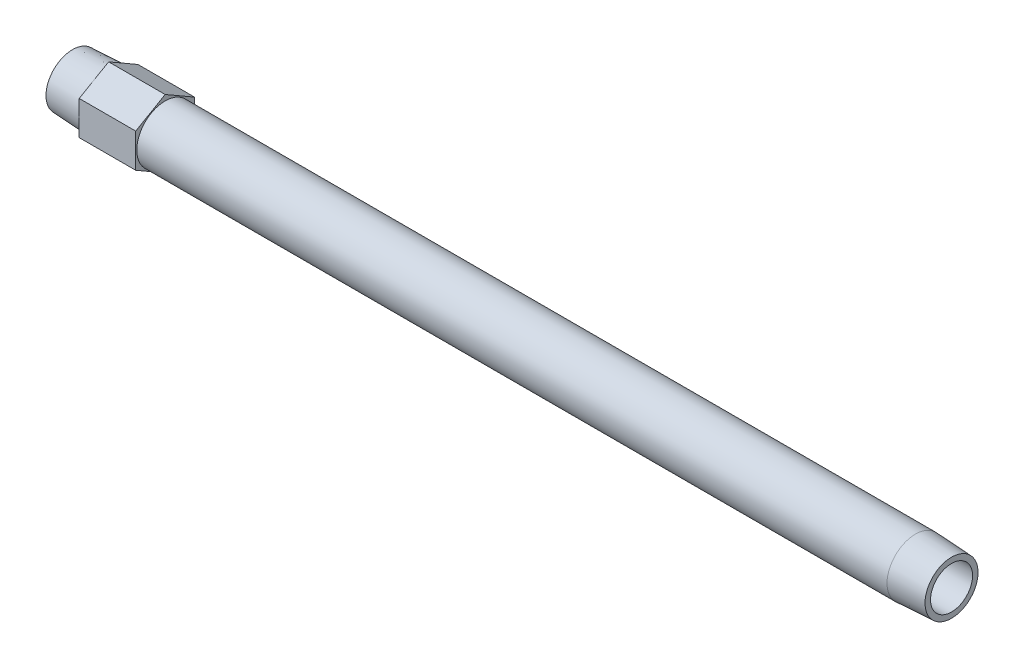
ISO-10303-21;
HEADER;
FILE_DESCRIPTION(('STEP AP214'),'2;1');
FILE_NAME('part.step','',(''),(''),'','','');
FILE_SCHEMA(('AUTOMOTIVE_DESIGN { 1 0 10303 214 1 1 1 1 }'));
ENDSEC;
DATA;
#1=APPLICATION_CONTEXT('core data for automotive mechanical design processes');
#2=APPLICATION_PROTOCOL_DEFINITION('international standard','automotive_design',2000,#1);
#3=PRODUCT_CONTEXT('',#1,'mechanical');
#4=PRODUCT('Part','Part','',(#3));
#5=PRODUCT_RELATED_PRODUCT_CATEGORY('part','',(#4));
#6=PRODUCT_DEFINITION_FORMATION('','',#4);
#7=PRODUCT_DEFINITION_CONTEXT('part definition',#1,'design');
#8=PRODUCT_DEFINITION('design','',#6,#7);
#9=PRODUCT_DEFINITION_SHAPE('','',#8);
#10=(LENGTH_UNIT() NAMED_UNIT(*) SI_UNIT(.MILLI.,.METRE.));
#11=(NAMED_UNIT(*) PLANE_ANGLE_UNIT() SI_UNIT($,.RADIAN.));
#12=(NAMED_UNIT(*) SI_UNIT($,.STERADIAN.) SOLID_ANGLE_UNIT());
#13=UNCERTAINTY_MEASURE_WITH_UNIT(LENGTH_MEASURE(1.E-05),#10,'distance_accuracy_value','');
#14=(GEOMETRIC_REPRESENTATION_CONTEXT(3) GLOBAL_UNCERTAINTY_ASSIGNED_CONTEXT((#13)) GLOBAL_UNIT_ASSIGNED_CONTEXT((#10,
#11,#12)) REPRESENTATION_CONTEXT('',''));
#15=CARTESIAN_POINT('',(0.,0.,0.));
#16=DIRECTION('',(0.,0.,1.));
#17=DIRECTION('',(1.,0.,0.));
#18=AXIS2_PLACEMENT_3D('',#15,#16,#17);
#19=CARTESIAN_POINT('',(0.,0.,-9.95716184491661));
#20=DIRECTION('',(1.,0.,0.));
#21=DIRECTION('',(0.,0.,-1.));
#22=AXIS2_PLACEMENT_3D('',#19,#20,#21);
#23=PLANE('',#22);
#24=CARTESIAN_POINT('',(0.,0.,0.));
#25=DIRECTION('',(-1.,0.,0.));
#26=DIRECTION('',(0.,0.,1.));
#27=AXIS2_PLACEMENT_3D('',#24,#25,#26);
#28=CIRCLE('',#27,9.95716184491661);
#29=CARTESIAN_POINT('',(0.,0.,9.95716184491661));
#30=VERTEX_POINT('',#29);
#31=EDGE_CURVE('E147',#30,#30,#28,.T.);
#32=ORIENTED_EDGE('',*,*,#31,.T.);
#33=EDGE_LOOP('',(#32));
#34=FACE_BOUND('',#33,.T.);
#35=CARTESIAN_POINT('',(0.,0.,0.));
#36=DIRECTION('',(1.,0.,0.));
#37=DIRECTION('',(0.,0.,1.));
#38=AXIS2_PLACEMENT_3D('',#35,#36,#37);
#39=CIRCLE('',#38,7.8994);
#40=CARTESIAN_POINT('',(0.,0.,7.8994));
#41=VERTEX_POINT('',#40);
#42=EDGE_CURVE('E159',#41,#41,#39,.T.);
#43=ORIENTED_EDGE('',*,*,#42,.T.);
#44=EDGE_LOOP('',(#43));
#45=FACE_BOUND('',#44,.T.);
#46=ADVANCED_FACE('F15',(#34,#45),#23,.F.);
#47=CARTESIAN_POINT('',(330.2,0.,-9.95716184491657));
#48=DIRECTION('',(-1.,0.,0.));
#49=DIRECTION('',(0.,0.,1.));
#50=AXIS2_PLACEMENT_3D('',#47,#48,#49);
#51=PLANE('',#50);
#52=CARTESIAN_POINT('',(330.2,0.,0.));
#53=DIRECTION('',(-1.,0.,0.));
#54=DIRECTION('',(0.,0.,1.));
#55=AXIS2_PLACEMENT_3D('',#52,#53,#54);
#56=CIRCLE('',#55,9.95716184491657);
#57=CARTESIAN_POINT('',(330.2,0.,9.95716184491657));
#58=VERTEX_POINT('',#57);
#59=EDGE_CURVE('E150',#58,#58,#56,.T.);
#60=ORIENTED_EDGE('',*,*,#59,.F.);
#61=EDGE_LOOP('',(#60));
#62=FACE_BOUND('',#61,.T.);
#63=CARTESIAN_POINT('',(330.2,0.,0.));
#64=DIRECTION('',(-1.,0.,0.));
#65=DIRECTION('',(0.,0.,1.));
#66=AXIS2_PLACEMENT_3D('',#63,#64,#65);
#67=CIRCLE('',#66,7.8994);
#68=CARTESIAN_POINT('',(330.2,0.,7.8994));
#69=VERTEX_POINT('',#68);
#70=EDGE_CURVE('E156',#69,#69,#67,.F.);
#71=ORIENTED_EDGE('',*,*,#70,.F.);
#72=EDGE_LOOP('',(#71));
#73=FACE_BOUND('',#72,.T.);
#74=ADVANCED_FACE('F178',(#62,#73),#51,.F.);
#75=CARTESIAN_POINT('',(34.798,-6.37914312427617,-11.049));
#76=DIRECTION('',(1.,0.,0.));
#77=DIRECTION('',(0.,1.,0.));
#78=AXIS2_PLACEMENT_3D('',#75,#76,#77);
#79=PLANE('',#78);
#80=DIRECTION('',(0.,0.5,-0.866025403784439));
#81=VECTOR('',#80,1.);
#82=CARTESIAN_POINT('',(34.798,-12.7582862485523,0.));
#83=LINE('',#82,#81);
#84=CARTESIAN_POINT('',(34.798,-12.7582862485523,0.));
#85=VERTEX_POINT('',#84);
#86=CARTESIAN_POINT('',(34.798,-6.37914312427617,-11.049));
#87=VERTEX_POINT('',#86);
#88=EDGE_CURVE('E103',#85,#87,#83,.T.);
#89=ORIENTED_EDGE('',*,*,#88,.T.);
#90=DIRECTION('',(0.,1.,0.));
#91=VECTOR('',#90,1.);
#92=CARTESIAN_POINT('',(34.798,-6.37914312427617,-11.049));
#93=LINE('',#92,#91);
#94=CARTESIAN_POINT('',(34.798,6.37914312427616,-11.049));
#95=VERTEX_POINT('',#94);
#96=EDGE_CURVE('E83',#87,#95,#93,.T.);
#97=ORIENTED_EDGE('',*,*,#96,.T.);
#98=DIRECTION('',(0.,0.5,0.866025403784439));
#99=VECTOR('',#98,1.);
#100=CARTESIAN_POINT('',(34.798,6.37914312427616,-11.049));
#101=LINE('',#100,#99);
#102=CARTESIAN_POINT('',(34.798,12.7582862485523,0.));
#103=VERTEX_POINT('',#102);
#104=EDGE_CURVE('E102',#95,#103,#101,.T.);
#105=ORIENTED_EDGE('',*,*,#104,.T.);
#106=DIRECTION('',(0.,-0.5,0.866025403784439));
#107=VECTOR('',#106,1.);
#108=CARTESIAN_POINT('',(34.798,12.7582862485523,0.));
#109=LINE('',#108,#107);
#110=CARTESIAN_POINT('',(34.798,6.37914312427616,11.049));
#111=VERTEX_POINT('',#110);
#112=EDGE_CURVE('E105',#103,#111,#109,.T.);
#113=ORIENTED_EDGE('',*,*,#112,.T.);
#114=DIRECTION('',(0.,-1.,0.));
#115=VECTOR('',#114,1.);
#116=CARTESIAN_POINT('',(34.798,6.37914312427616,11.049));
#117=LINE('',#116,#115);
#118=CARTESIAN_POINT('',(34.798,-6.37914312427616,11.049));
#119=VERTEX_POINT('',#118);
#120=EDGE_CURVE('E35',#111,#119,#117,.T.);
#121=ORIENTED_EDGE('',*,*,#120,.T.);
#122=DIRECTION('',(0.,-0.5,-0.866025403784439));
#123=VECTOR('',#122,1.);
#124=CARTESIAN_POINT('',(34.798,-6.37914312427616,11.049));
#125=LINE('',#124,#123);
#126=EDGE_CURVE('E30',#119,#85,#125,.T.);
#127=ORIENTED_EDGE('',*,*,#126,.T.);
#128=EDGE_LOOP('',(#89,#97,#105,#113,#121,#127));
#129=FACE_BOUND('',#128,.T.);
#130=CARTESIAN_POINT('',(34.798,0.,0.));
#131=DIRECTION('',(1.,0.,0.));
#132=DIRECTION('',(0.,1.,0.));
#133=AXIS2_PLACEMENT_3D('',#130,#131,#132);
#134=CIRCLE('',#133,10.668);
#135=CARTESIAN_POINT('',(34.798,10.668,0.));
#136=VERTEX_POINT('',#135);
#137=EDGE_CURVE('E89',#136,#136,#134,.F.);
#138=ORIENTED_EDGE('',*,*,#137,.T.);
#139=EDGE_LOOP('',(#138));
#140=FACE_BOUND('',#139,.T.);
#141=ADVANCED_FACE('F124',(#129,#140),#79,.T.);
#142=CARTESIAN_POINT('',(13.5636,-6.37914312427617,-11.049));
#143=DIRECTION('',(1.,0.,0.));
#144=DIRECTION('',(0.,1.,0.));
#145=AXIS2_PLACEMENT_3D('',#142,#143,#144);
#146=PLANE('',#145);
#147=DIRECTION('',(0.,0.5,-0.866025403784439));
#148=VECTOR('',#147,1.);
#149=CARTESIAN_POINT('',(13.5636,-12.7582862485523,0.));
#150=LINE('',#149,#148);
#151=CARTESIAN_POINT('',(13.5636,-12.7582862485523,0.));
#152=VERTEX_POINT('',#151);
#153=CARTESIAN_POINT('',(13.5636,-6.37914312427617,-11.049));
#154=VERTEX_POINT('',#153);
#155=EDGE_CURVE('E73',#152,#154,#150,.T.);
#156=ORIENTED_EDGE('',*,*,#155,.F.);
#157=DIRECTION('',(0.,-0.5,-0.866025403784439));
#158=VECTOR('',#157,1.);
#159=CARTESIAN_POINT('',(13.5636,-6.37914312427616,11.049));
#160=LINE('',#159,#158);
#161=CARTESIAN_POINT('',(13.5636,-6.37914312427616,11.049));
#162=VERTEX_POINT('',#161);
#163=EDGE_CURVE('E99',#162,#152,#160,.T.);
#164=ORIENTED_EDGE('',*,*,#163,.F.);
#165=DIRECTION('',(0.,-1.,0.));
#166=VECTOR('',#165,1.);
#167=CARTESIAN_POINT('',(13.5636,6.37914312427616,11.049));
#168=LINE('',#167,#166);
#169=CARTESIAN_POINT('',(13.5636,6.37914312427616,11.049));
#170=VERTEX_POINT('',#169);
#171=EDGE_CURVE('E133',#170,#162,#168,.T.);
#172=ORIENTED_EDGE('',*,*,#171,.F.);
#173=DIRECTION('',(0.,-0.5,0.866025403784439));
#174=VECTOR('',#173,1.);
#175=CARTESIAN_POINT('',(13.5636,12.7582862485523,0.));
#176=LINE('',#175,#174);
#177=CARTESIAN_POINT('',(13.5636,12.7582862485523,0.));
#178=VERTEX_POINT('',#177);
#179=EDGE_CURVE('E129',#178,#170,#176,.T.);
#180=ORIENTED_EDGE('',*,*,#179,.F.);
#181=DIRECTION('',(0.,0.5,0.866025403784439));
#182=VECTOR('',#181,1.);
#183=CARTESIAN_POINT('',(13.5636,6.37914312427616,-11.049));
#184=LINE('',#183,#182);
#185=CARTESIAN_POINT('',(13.5636,6.37914312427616,-11.049));
#186=VERTEX_POINT('',#185);
#187=EDGE_CURVE('E75',#186,#178,#184,.T.);
#188=ORIENTED_EDGE('',*,*,#187,.F.);
#189=DIRECTION('',(0.,1.,0.));
#190=VECTOR('',#189,1.);
#191=CARTESIAN_POINT('',(13.5636,-6.37914312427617,-11.049));
#192=LINE('',#191,#190);
#193=EDGE_CURVE('E68',#154,#186,#192,.T.);
#194=ORIENTED_EDGE('',*,*,#193,.F.);
#195=EDGE_LOOP('',(#156,#164,#172,#180,#188,#194));
#196=FACE_BOUND('',#195,.T.);
#197=CARTESIAN_POINT('',(13.5636,0.,0.));
#198=DIRECTION('',(-1.,0.,0.));
#199=DIRECTION('',(0.,0.,1.));
#200=AXIS2_PLACEMENT_3D('',#197,#198,#199);
#201=CIRCLE('',#200,10.668);
#202=CARTESIAN_POINT('',(13.5636,0.,10.668));
#203=VERTEX_POINT('',#202);
#204=EDGE_CURVE('E95',#203,#203,#201,.T.);
#205=ORIENTED_EDGE('',*,*,#204,.F.);
#206=EDGE_LOOP('',(#205));
#207=FACE_BOUND('',#206,.T.);
#208=ADVANCED_FACE('F69',(#196,#207),#146,.F.);
#209=CARTESIAN_POINT('',(34.798,-12.7582862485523,0.));
#210=DIRECTION('',(0.,0.866025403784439,0.5));
#211=DIRECTION('',(0.,-0.5,0.866025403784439));
#212=AXIS2_PLACEMENT_3D('',#209,#210,#211);
#213=PLANE('',#212);
#214=ORIENTED_EDGE('',*,*,#155,.T.);
#215=DIRECTION('',(-1.,0.,0.));
#216=VECTOR('',#215,1.);
#217=CARTESIAN_POINT('',(34.798,-6.37914312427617,-11.049));
#218=LINE('',#217,#216);
#219=EDGE_CURVE('E10',#87,#154,#218,.T.);
#220=ORIENTED_EDGE('',*,*,#219,.F.);
#221=ORIENTED_EDGE('',*,*,#88,.F.);
#222=DIRECTION('',(-1.,0.,0.));
#223=VECTOR('',#222,1.);
#224=CARTESIAN_POINT('',(34.798,-12.7582862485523,0.));
#225=LINE('',#224,#223);
#226=EDGE_CURVE('E87',#85,#152,#225,.T.);
#227=ORIENTED_EDGE('',*,*,#226,.T.);
#228=EDGE_LOOP('',(#214,#220,#221,#227));
#229=FACE_BOUND('',#228,.T.);
#230=ADVANCED_FACE('F17',(#229),#213,.F.);
#231=CARTESIAN_POINT('',(34.798,-6.37914312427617,-11.049));
#232=DIRECTION('',(0.,0.,1.));
#233=DIRECTION('',(1.,0.,0.));
#234=AXIS2_PLACEMENT_3D('',#231,#232,#233);
#235=PLANE('',#234);
#236=ORIENTED_EDGE('',*,*,#193,.T.);
#237=DIRECTION('',(-1.,0.,0.));
#238=VECTOR('',#237,1.);
#239=CARTESIAN_POINT('',(34.798,6.37914312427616,-11.049));
#240=LINE('',#239,#238);
#241=EDGE_CURVE('E23',#95,#186,#240,.T.);
#242=ORIENTED_EDGE('',*,*,#241,.F.);
#243=ORIENTED_EDGE('',*,*,#96,.F.);
#244=ORIENTED_EDGE('',*,*,#219,.T.);
#245=EDGE_LOOP('',(#236,#242,#243,#244));
#246=FACE_BOUND('',#245,.T.);
#247=ADVANCED_FACE('F82',(#246),#235,.F.);
#248=CARTESIAN_POINT('',(34.798,6.37914312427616,-11.049));
#249=DIRECTION('',(0.,-0.866025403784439,0.5));
#250=DIRECTION('',(0.,-0.5,-0.866025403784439));
#251=AXIS2_PLACEMENT_3D('',#248,#249,#250);
#252=PLANE('',#251);
#253=ORIENTED_EDGE('',*,*,#187,.T.);
#254=DIRECTION('',(-1.,0.,0.));
#255=VECTOR('',#254,1.);
#256=CARTESIAN_POINT('',(34.798,12.7582862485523,0.));
#257=LINE('',#256,#255);
#258=EDGE_CURVE('E117',#103,#178,#257,.T.);
#259=ORIENTED_EDGE('',*,*,#258,.F.);
#260=ORIENTED_EDGE('',*,*,#104,.F.);
#261=ORIENTED_EDGE('',*,*,#241,.T.);
#262=EDGE_LOOP('',(#253,#259,#260,#261));
#263=FACE_BOUND('',#262,.T.);
#264=ADVANCED_FACE('F121',(#263),#252,.F.);
#265=CARTESIAN_POINT('',(34.798,12.7582862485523,0.));
#266=DIRECTION('',(0.,-0.866025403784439,-0.5));
#267=DIRECTION('',(0.,0.5,-0.866025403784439));
#268=AXIS2_PLACEMENT_3D('',#265,#266,#267);
#269=PLANE('',#268);
#270=ORIENTED_EDGE('',*,*,#179,.T.);
#271=DIRECTION('',(-1.,0.,0.));
#272=VECTOR('',#271,1.);
#273=CARTESIAN_POINT('',(34.798,6.37914312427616,11.049));
#274=LINE('',#273,#272);
#275=EDGE_CURVE('E114',#111,#170,#274,.T.);
#276=ORIENTED_EDGE('',*,*,#275,.F.);
#277=ORIENTED_EDGE('',*,*,#112,.F.);
#278=ORIENTED_EDGE('',*,*,#258,.T.);
#279=EDGE_LOOP('',(#270,#276,#277,#278));
#280=FACE_BOUND('',#279,.T.);
#281=ADVANCED_FACE('F128',(#280),#269,.F.);
#282=CARTESIAN_POINT('',(34.798,6.37914312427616,11.049));
#283=DIRECTION('',(0.,0.,-1.));
#284=DIRECTION('',(-1.,0.,0.));
#285=AXIS2_PLACEMENT_3D('',#282,#283,#284);
#286=PLANE('',#285);
#287=ORIENTED_EDGE('',*,*,#171,.T.);
#288=DIRECTION('',(-1.,0.,0.));
#289=VECTOR('',#288,1.);
#290=CARTESIAN_POINT('',(34.798,-6.37914312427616,11.049));
#291=LINE('',#290,#289);
#292=EDGE_CURVE('E111',#119,#162,#291,.T.);
#293=ORIENTED_EDGE('',*,*,#292,.F.);
#294=ORIENTED_EDGE('',*,*,#120,.F.);
#295=ORIENTED_EDGE('',*,*,#275,.T.);
#296=EDGE_LOOP('',(#287,#293,#294,#295));
#297=FACE_BOUND('',#296,.T.);
#298=ADVANCED_FACE('F132',(#297),#286,.F.);
#299=CARTESIAN_POINT('',(34.798,-6.37914312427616,11.049));
#300=DIRECTION('',(0.,0.866025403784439,-0.5));
#301=DIRECTION('',(0.,0.5,0.866025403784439));
#302=AXIS2_PLACEMENT_3D('',#299,#300,#301);
#303=PLANE('',#302);
#304=ORIENTED_EDGE('',*,*,#163,.T.);
#305=ORIENTED_EDGE('',*,*,#226,.F.);
#306=ORIENTED_EDGE('',*,*,#126,.F.);
#307=ORIENTED_EDGE('',*,*,#292,.T.);
#308=EDGE_LOOP('',(#304,#305,#306,#307));
#309=FACE_BOUND('',#308,.T.);
#310=ADVANCED_FACE('F135',(#309),#303,.F.);
#311=CARTESIAN_POINT('',(13.5636,0.,0.));
#312=DIRECTION('',(1.,0.,0.));
#313=DIRECTION('',(0.,0.,-1.));
#314=AXIS2_PLACEMENT_3D('',#311,#312,#313);
#315=CONICAL_SURFACE('',#314,10.668,0.0523598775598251);
#316=ORIENTED_EDGE('',*,*,#31,.F.);
#317=EDGE_LOOP('',(#316));
#318=FACE_BOUND('',#317,.T.);
#319=ORIENTED_EDGE('',*,*,#204,.T.);
#320=EDGE_LOOP('',(#319));
#321=FACE_BOUND('',#320,.T.);
#322=ADVANCED_FACE('F187',(#318,#321),#315,.T.);
#323=CARTESIAN_POINT('',(-60.,0.,0.));
#324=DIRECTION('',(-1.,0.,0.));
#325=DIRECTION('',(0.,0.,1.));
#326=AXIS2_PLACEMENT_3D('',#323,#324,#325);
#327=CYLINDRICAL_SURFACE('',#326,10.668);
#328=ORIENTED_EDGE('',*,*,#137,.F.);
#329=EDGE_LOOP('',(#328));
#330=FACE_BOUND('',#329,.T.);
#331=CARTESIAN_POINT('',(316.6364,0.,0.));
#332=DIRECTION('',(-1.,0.,0.));
#333=DIRECTION('',(0.,0.,1.));
#334=AXIS2_PLACEMENT_3D('',#331,#332,#333);
#335=CIRCLE('',#334,10.668);
#336=CARTESIAN_POINT('',(316.6364,0.,10.668));
#337=VERTEX_POINT('',#336);
#338=EDGE_CURVE('E153',#337,#337,#335,.T.);
#339=ORIENTED_EDGE('',*,*,#338,.T.);
#340=EDGE_LOOP('',(#339));
#341=FACE_BOUND('',#340,.T.);
#342=ADVANCED_FACE('F174',(#330,#341),#327,.T.);
#343=CARTESIAN_POINT('',(330.2,0.,0.));
#344=DIRECTION('',(-1.,0.,0.));
#345=DIRECTION('',(0.,0.,1.));
#346=AXIS2_PLACEMENT_3D('',#343,#344,#345);
#347=CONICAL_SURFACE('',#346,9.95716184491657,0.0523598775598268);
#348=ORIENTED_EDGE('',*,*,#338,.F.);
#349=EDGE_LOOP('',(#348));
#350=FACE_BOUND('',#349,.T.);
#351=ORIENTED_EDGE('',*,*,#59,.T.);
#352=EDGE_LOOP('',(#351));
#353=FACE_BOUND('',#352,.T.);
#354=ADVANCED_FACE('F167',(#350,#353),#347,.T.);
#355=CARTESIAN_POINT('',(331.920859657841,0.,0.));
#356=DIRECTION('',(-1.,0.,0.));
#357=DIRECTION('',(0.,0.,1.));
#358=AXIS2_PLACEMENT_3D('',#355,#356,#357);
#359=CYLINDRICAL_SURFACE('',#358,7.8994);
#360=ORIENTED_EDGE('',*,*,#70,.T.);
#361=EDGE_LOOP('',(#360));
#362=FACE_BOUND('',#361,.T.);
#363=ORIENTED_EDGE('',*,*,#42,.F.);
#364=EDGE_LOOP('',(#363));
#365=FACE_BOUND('',#364,.T.);
#366=ADVANCED_FACE('F165',(#362,#365),#359,.F.);
#367=CLOSED_SHELL('',(#46,#74,#141,#208,#230,#247,#264,#281,#298,#310,#322,#342,#354,#366));
#368=MANIFOLD_SOLID_BREP('B1',#367);
#369=ADVANCED_BREP_SHAPE_REPRESENTATION('',(#18,#368),#14);
#370=SHAPE_DEFINITION_REPRESENTATION(#9,#369);
ENDSEC;
END-ISO-10303-21;
